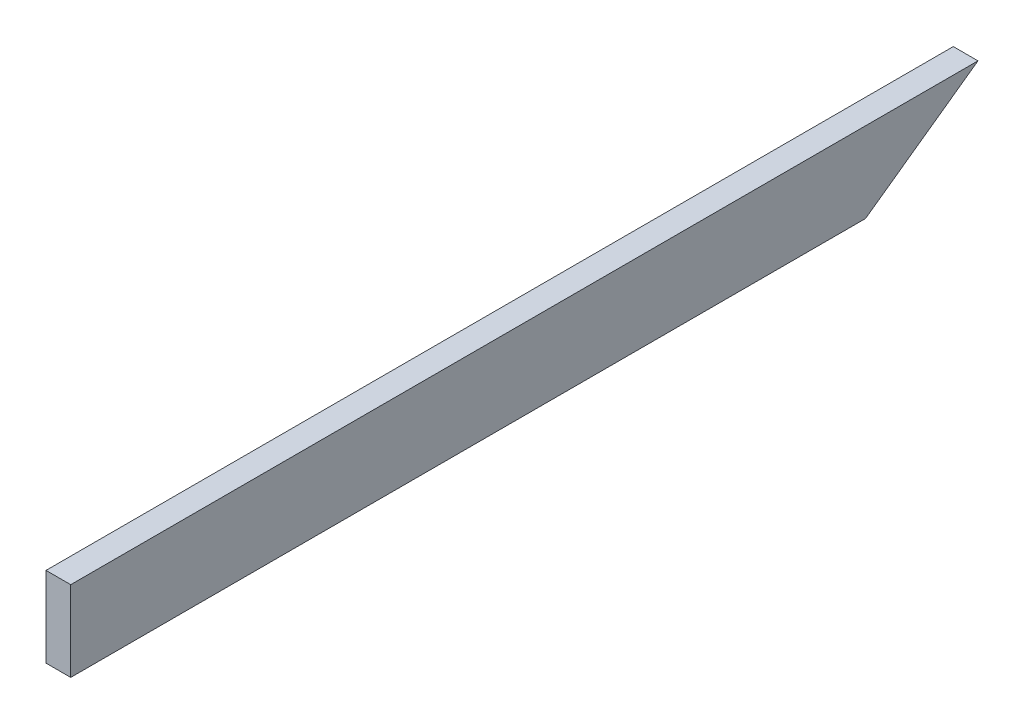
from build123d import *

# Parameters (mm, degrees)
ESQUISSE1_W             = 4
ESQUISSE1_H             = 13
EXTRUSION1_DEPTH        = 150
ENL_V_MAT_EXTRU_1_DEPTH = 10


with BuildPart() as part:
    # Esquisse1 → Extrusion1 (new, symmetric)
    with BuildSketch(Plane.XY):
        Rectangle(ESQUISSE1_W, ESQUISSE1_H)
    extrude(amount=EXTRUSION1_DEPTH, both=True)

    # Esquisse2 → Enl_v. mat.-Extru.1 (cut)
    with BuildSketch(Plane.ZY.offset(2)):
        Polygon((-150, 6.5), (-150, -6.5), (21.390380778, -6.5), (3.18897153, 6.5), align=None)
    extrude(amount=-ENL_V_MAT_EXTRU_1_DEPTH, mode=Mode.SUBTRACT)


solid = part.part
